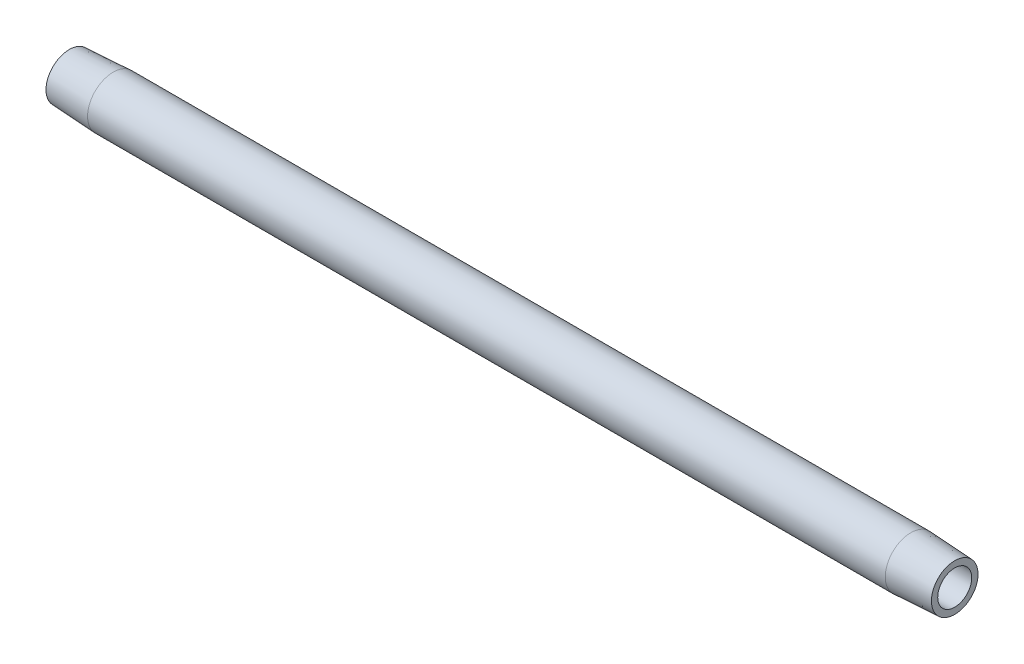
ISO-10303-21;
HEADER;
FILE_DESCRIPTION(('STEP AP214'),'2;1');
FILE_NAME('part.step','',(''),(''),'','','');
FILE_SCHEMA(('AUTOMOTIVE_DESIGN { 1 0 10303 214 1 1 1 1 }'));
ENDSEC;
DATA;
#1=APPLICATION_CONTEXT('core data for automotive mechanical design processes');
#2=APPLICATION_PROTOCOL_DEFINITION('international standard','automotive_design',2000,#1);
#3=PRODUCT_CONTEXT('',#1,'mechanical');
#4=PRODUCT('Part','Part','',(#3));
#5=PRODUCT_RELATED_PRODUCT_CATEGORY('part','',(#4));
#6=PRODUCT_DEFINITION_FORMATION('','',#4);
#7=PRODUCT_DEFINITION_CONTEXT('part definition',#1,'design');
#8=PRODUCT_DEFINITION('design','',#6,#7);
#9=PRODUCT_DEFINITION_SHAPE('','',#8);
#10=(LENGTH_UNIT() NAMED_UNIT(*) SI_UNIT(.MILLI.,.METRE.));
#11=(NAMED_UNIT(*) PLANE_ANGLE_UNIT() SI_UNIT($,.RADIAN.));
#12=(NAMED_UNIT(*) SI_UNIT($,.STERADIAN.) SOLID_ANGLE_UNIT());
#13=UNCERTAINTY_MEASURE_WITH_UNIT(LENGTH_MEASURE(1.E-05),#10,'distance_accuracy_value','');
#14=(GEOMETRIC_REPRESENTATION_CONTEXT(3) GLOBAL_UNCERTAINTY_ASSIGNED_CONTEXT((#13)) GLOBAL_UNIT_ASSIGNED_CONTEXT((#10,
#11,#12)) REPRESENTATION_CONTEXT('',''));
#15=CARTESIAN_POINT('',(0.,0.,0.));
#16=DIRECTION('',(0.,0.,1.));
#17=DIRECTION('',(1.,0.,0.));
#18=AXIS2_PLACEMENT_3D('',#15,#16,#17);
#19=CARTESIAN_POINT('',(0.476141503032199,0.,0.));
#20=DIRECTION('',(-1.,0.,0.));
#21=DIRECTION('',(0.,0.,1.));
#22=AXIS2_PLACEMENT_3D('',#19,#20,#21);
#23=CYLINDRICAL_SURFACE('',#22,5.14349999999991);
#24=CARTESIAN_POINT('',(8.8100393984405,0.,0.));
#25=DIRECTION('',(-1.,0.,0.));
#26=DIRECTION('',(0.,0.,1.));
#27=AXIS2_PLACEMENT_3D('',#24,#25,#26);
#28=CIRCLE('',#27,5.14349999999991);
#29=CARTESIAN_POINT('',(8.8100393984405,0.,5.14349999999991));
#30=VERTEX_POINT('',#29);
#31=EDGE_CURVE('E10',#30,#30,#28,.T.);
#32=ORIENTED_EDGE('',*,*,#31,.F.);
#33=EDGE_LOOP('',(#32));
#34=FACE_BOUND('',#33,.T.);
#35=CARTESIAN_POINT('',(168.989960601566,0.,0.));
#36=DIRECTION('',(-1.,0.,0.));
#37=DIRECTION('',(0.,0.,1.));
#38=AXIS2_PLACEMENT_3D('',#35,#36,#37);
#39=CIRCLE('',#38,5.14349999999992);
#40=CARTESIAN_POINT('',(168.989960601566,0.,5.14349999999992));
#41=VERTEX_POINT('',#40);
#42=EDGE_CURVE('E52',#41,#41,#39,.T.);
#43=ORIENTED_EDGE('',*,*,#42,.T.);
#44=EDGE_LOOP('',(#43));
#45=FACE_BOUND('',#44,.T.);
#46=ADVANCED_FACE('F30',(#34,#45),#23,.T.);
#47=CARTESIAN_POINT('',(8.8100393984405,0.,0.));
#48=DIRECTION('',(1.,0.,0.));
#49=DIRECTION('',(0.,0.,-1.));
#50=AXIS2_PLACEMENT_3D('',#47,#48,#49);
#51=CONICAL_SURFACE('',#50,5.14349999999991,0.0523598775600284);
#52=CARTESIAN_POINT('',(0.,0.,0.));
#53=DIRECTION('',(-1.,0.,0.));
#54=DIRECTION('',(0.,0.,1.));
#55=AXIS2_PLACEMENT_3D('',#52,#53,#54);
#56=CIRCLE('',#55,4.68178539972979);
#57=CARTESIAN_POINT('',(0.,0.,4.68178539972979));
#58=VERTEX_POINT('',#57);
#59=EDGE_CURVE('E36',#58,#58,#56,.T.);
#60=ORIENTED_EDGE('',*,*,#59,.F.);
#61=EDGE_LOOP('',(#60));
#62=FACE_BOUND('',#61,.T.);
#63=ORIENTED_EDGE('',*,*,#31,.T.);
#64=EDGE_LOOP('',(#63));
#65=FACE_BOUND('',#64,.T.);
#66=ADVANCED_FACE('F77',(#62,#65),#51,.T.);
#67=CARTESIAN_POINT('',(0.,4.68178539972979,0.));
#68=DIRECTION('',(1.,0.,0.));
#69=DIRECTION('',(0.,0.,-1.));
#70=AXIS2_PLACEMENT_3D('',#67,#68,#69);
#71=PLANE('',#70);
#72=CARTESIAN_POINT('',(0.,0.,0.));
#73=DIRECTION('',(-1.,0.,0.));
#74=DIRECTION('',(0.,0.,1.));
#75=AXIS2_PLACEMENT_3D('',#72,#73,#74);
#76=CIRCLE('',#75,3.4163);
#77=CARTESIAN_POINT('',(0.,0.,3.4163));
#78=VERTEX_POINT('',#77);
#79=EDGE_CURVE('E40',#78,#78,#76,.T.);
#80=ORIENTED_EDGE('',*,*,#79,.F.);
#81=EDGE_LOOP('',(#80));
#82=FACE_BOUND('',#81,.T.);
#83=ORIENTED_EDGE('',*,*,#59,.T.);
#84=EDGE_LOOP('',(#83));
#85=FACE_BOUND('',#84,.T.);
#86=ADVANCED_FACE('F72',(#82,#85),#71,.F.);
#87=CARTESIAN_POINT('',(0.476141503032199,0.,0.));
#88=DIRECTION('',(-1.,0.,0.));
#89=DIRECTION('',(0.,0.,1.));
#90=AXIS2_PLACEMENT_3D('',#87,#88,#89);
#91=CYLINDRICAL_SURFACE('',#90,3.4163);
#92=CARTESIAN_POINT('',(177.8,0.,0.));
#93=DIRECTION('',(-1.,0.,0.));
#94=DIRECTION('',(0.,0.,1.));
#95=AXIS2_PLACEMENT_3D('',#92,#93,#94);
#96=CIRCLE('',#95,3.41630000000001);
#97=CARTESIAN_POINT('',(177.8,0.,3.41630000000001));
#98=VERTEX_POINT('',#97);
#99=EDGE_CURVE('E44',#98,#98,#96,.T.);
#100=ORIENTED_EDGE('',*,*,#99,.F.);
#101=EDGE_LOOP('',(#100));
#102=FACE_BOUND('',#101,.T.);
#103=ORIENTED_EDGE('',*,*,#79,.T.);
#104=EDGE_LOOP('',(#103));
#105=FACE_BOUND('',#104,.T.);
#106=ADVANCED_FACE('F66',(#102,#105),#91,.F.);
#107=CARTESIAN_POINT('',(177.8,3.41630000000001,0.));
#108=DIRECTION('',(-1.,0.,0.));
#109=DIRECTION('',(0.,0.,1.));
#110=AXIS2_PLACEMENT_3D('',#107,#108,#109);
#111=PLANE('',#110);
#112=CARTESIAN_POINT('',(177.8,0.,0.));
#113=DIRECTION('',(-1.,0.,0.));
#114=DIRECTION('',(0.,0.,1.));
#115=AXIS2_PLACEMENT_3D('',#112,#113,#114);
#116=CIRCLE('',#115,4.68178539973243);
#117=CARTESIAN_POINT('',(177.8,0.,4.68178539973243));
#118=VERTEX_POINT('',#117);
#119=EDGE_CURVE('E49',#118,#118,#116,.T.);
#120=ORIENTED_EDGE('',*,*,#119,.F.);
#121=EDGE_LOOP('',(#120));
#122=FACE_BOUND('',#121,.T.);
#123=ORIENTED_EDGE('',*,*,#99,.T.);
#124=EDGE_LOOP('',(#123));
#125=FACE_BOUND('',#124,.T.);
#126=ADVANCED_FACE('F60',(#122,#125),#111,.F.);
#127=CARTESIAN_POINT('',(177.8,0.,0.));
#128=DIRECTION('',(-1.,0.,0.));
#129=DIRECTION('',(0.,0.,1.));
#130=AXIS2_PLACEMENT_3D('',#127,#128,#129);
#131=CONICAL_SURFACE('',#130,4.68178539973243,0.0523598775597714);
#132=ORIENTED_EDGE('',*,*,#42,.F.);
#133=EDGE_LOOP('',(#132));
#134=FACE_BOUND('',#133,.T.);
#135=ORIENTED_EDGE('',*,*,#119,.T.);
#136=EDGE_LOOP('',(#135));
#137=FACE_BOUND('',#136,.T.);
#138=ADVANCED_FACE('F57',(#134,#137),#131,.T.);
#139=CLOSED_SHELL('',(#46,#66,#86,#106,#126,#138));
#140=MANIFOLD_SOLID_BREP('B2',#139);
#141=ADVANCED_BREP_SHAPE_REPRESENTATION('',(#18,#140),#14);
#142=SHAPE_DEFINITION_REPRESENTATION(#9,#141);
ENDSEC;
END-ISO-10303-21;
